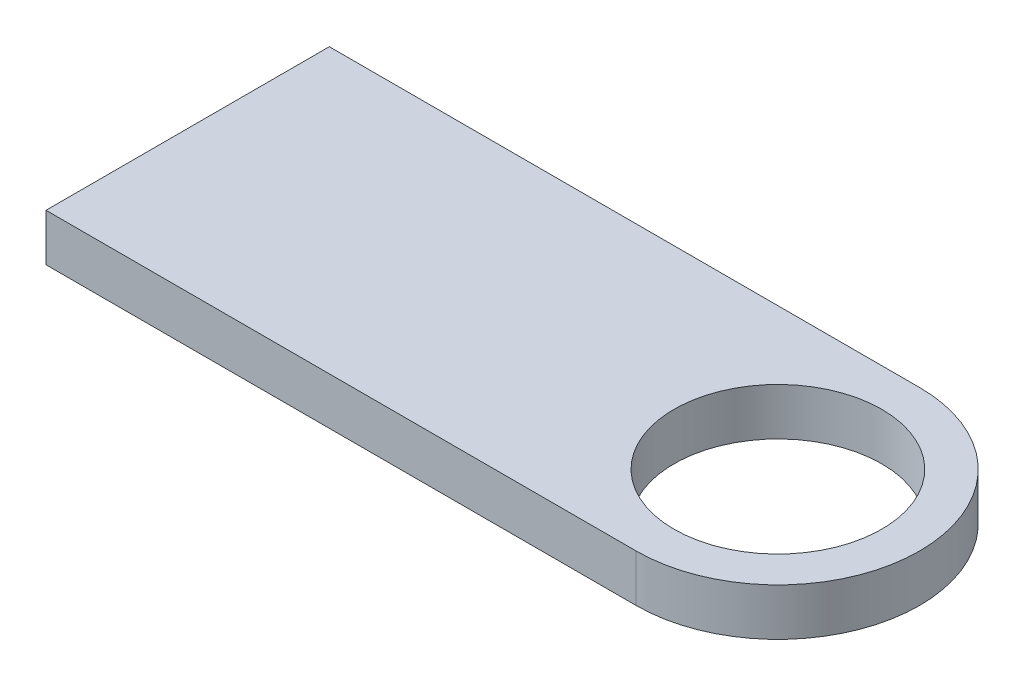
ISO-10303-21;
HEADER;
FILE_DESCRIPTION(('STEP AP214'),'2;1');
FILE_NAME('part.step','',(''),(''),'','','');
FILE_SCHEMA(('AUTOMOTIVE_DESIGN { 1 0 10303 214 1 1 1 1 }'));
ENDSEC;
DATA;
#1=APPLICATION_CONTEXT('core data for automotive mechanical design processes');
#2=APPLICATION_PROTOCOL_DEFINITION('international standard','automotive_design',2000,#1);
#3=PRODUCT_CONTEXT('',#1,'mechanical');
#4=PRODUCT('Part','Part','',(#3));
#5=PRODUCT_RELATED_PRODUCT_CATEGORY('part','',(#4));
#6=PRODUCT_DEFINITION_FORMATION('','',#4);
#7=PRODUCT_DEFINITION_CONTEXT('part definition',#1,'design');
#8=PRODUCT_DEFINITION('design','',#6,#7);
#9=PRODUCT_DEFINITION_SHAPE('','',#8);
#10=(LENGTH_UNIT() NAMED_UNIT(*) SI_UNIT(.MILLI.,.METRE.));
#11=(NAMED_UNIT(*) PLANE_ANGLE_UNIT() SI_UNIT($,.RADIAN.));
#12=(NAMED_UNIT(*) SI_UNIT($,.STERADIAN.) SOLID_ANGLE_UNIT());
#13=UNCERTAINTY_MEASURE_WITH_UNIT(LENGTH_MEASURE(1.E-05),#10,'distance_accuracy_value','');
#14=(GEOMETRIC_REPRESENTATION_CONTEXT(3) GLOBAL_UNCERTAINTY_ASSIGNED_CONTEXT((#13)) GLOBAL_UNIT_ASSIGNED_CONTEXT((#10,
#11,#12)) REPRESENTATION_CONTEXT('',''));
#15=CARTESIAN_POINT('',(0.,0.,0.));
#16=DIRECTION('',(0.,0.,1.));
#17=DIRECTION('',(1.,0.,0.));
#18=AXIS2_PLACEMENT_3D('',#15,#16,#17);
#19=CARTESIAN_POINT('',(125.,-5.,-60.));
#20=DIRECTION('',(0.,0.,-1.));
#21=DIRECTION('',(-1.,0.,0.));
#22=AXIS2_PLACEMENT_3D('',#19,#20,#21);
#23=PLANE('',#22);
#24=DIRECTION('',(-1.,0.,0.));
#25=VECTOR('',#24,1.);
#26=CARTESIAN_POINT('',(125.,5.,-60.));
#27=LINE('',#26,#25);
#28=CARTESIAN_POINT('',(125.,5.,-60.));
#29=VERTEX_POINT('',#28);
#30=CARTESIAN_POINT('',(0.,5.,-60.));
#31=VERTEX_POINT('',#30);
#32=EDGE_CURVE('E100',#29,#31,#27,.T.);
#33=ORIENTED_EDGE('',*,*,#32,.F.);
#34=DIRECTION('',(0.,1.,0.));
#35=VECTOR('',#34,1.);
#36=CARTESIAN_POINT('',(125.,-5.,-60.));
#37=LINE('',#36,#35);
#38=CARTESIAN_POINT('',(125.,-5.,-60.));
#39=VERTEX_POINT('',#38);
#40=EDGE_CURVE('E11',#39,#29,#37,.T.);
#41=ORIENTED_EDGE('',*,*,#40,.F.);
#42=DIRECTION('',(-1.,0.,0.));
#43=VECTOR('',#42,1.);
#44=CARTESIAN_POINT('',(125.,-5.,-60.));
#45=LINE('',#44,#43);
#46=CARTESIAN_POINT('',(0.,-5.,-60.));
#47=VERTEX_POINT('',#46);
#48=EDGE_CURVE('E93',#39,#47,#45,.T.);
#49=ORIENTED_EDGE('',*,*,#48,.T.);
#50=DIRECTION('',(0.,1.,0.));
#51=VECTOR('',#50,1.);
#52=CARTESIAN_POINT('',(0.,-5.,-60.));
#53=LINE('',#52,#51);
#54=EDGE_CURVE('E38',#47,#31,#53,.T.);
#55=ORIENTED_EDGE('',*,*,#54,.T.);
#56=EDGE_LOOP('',(#33,#41,#49,#55));
#57=FACE_BOUND('',#56,.T.);
#58=ADVANCED_FACE('F35',(#57),#23,.T.);
#59=CARTESIAN_POINT('',(125.,-5.,-30.));
#60=DIRECTION('',(0.,1.,0.));
#61=DIRECTION('',(0.,0.,1.));
#62=AXIS2_PLACEMENT_3D('',#59,#60,#61);
#63=CYLINDRICAL_SURFACE('',#62,30.);
#64=CARTESIAN_POINT('',(125.,5.,-30.));
#65=DIRECTION('',(0.,1.,0.));
#66=DIRECTION('',(0.,0.,1.));
#67=AXIS2_PLACEMENT_3D('',#64,#65,#66);
#68=CIRCLE('',#67,30.);
#69=CARTESIAN_POINT('',(125.,5.,0.));
#70=VERTEX_POINT('',#69);
#71=EDGE_CURVE('E95',#70,#29,#68,.T.);
#72=ORIENTED_EDGE('',*,*,#71,.F.);
#73=DIRECTION('',(0.,1.,0.));
#74=VECTOR('',#73,1.);
#75=CARTESIAN_POINT('',(125.,-5.,0.));
#76=LINE('',#75,#74);
#77=CARTESIAN_POINT('',(125.,-5.,0.));
#78=VERTEX_POINT('',#77);
#79=EDGE_CURVE('E44',#78,#70,#76,.T.);
#80=ORIENTED_EDGE('',*,*,#79,.F.);
#81=CARTESIAN_POINT('',(125.,-5.,-30.));
#82=DIRECTION('',(0.,1.,0.));
#83=DIRECTION('',(0.,0.,1.));
#84=AXIS2_PLACEMENT_3D('',#81,#82,#83);
#85=CIRCLE('',#84,30.);
#86=EDGE_CURVE('E90',#78,#39,#85,.T.);
#87=ORIENTED_EDGE('',*,*,#86,.T.);
#88=ORIENTED_EDGE('',*,*,#40,.T.);
#89=EDGE_LOOP('',(#72,#80,#87,#88));
#90=FACE_BOUND('',#89,.T.);
#91=ADVANCED_FACE('F111',(#90),#63,.T.);
#92=CARTESIAN_POINT('',(0.,-5.,0.));
#93=DIRECTION('',(0.,0.,1.));
#94=DIRECTION('',(1.,0.,0.));
#95=AXIS2_PLACEMENT_3D('',#92,#93,#94);
#96=PLANE('',#95);
#97=DIRECTION('',(1.,0.,0.));
#98=VECTOR('',#97,1.);
#99=CARTESIAN_POINT('',(0.,5.,0.));
#100=LINE('',#99,#98);
#101=CARTESIAN_POINT('',(0.,5.,0.));
#102=VERTEX_POINT('',#101);
#103=EDGE_CURVE('E85',#102,#70,#100,.T.);
#104=ORIENTED_EDGE('',*,*,#103,.F.);
#105=DIRECTION('',(0.,1.,0.));
#106=VECTOR('',#105,1.);
#107=CARTESIAN_POINT('',(0.,-5.,0.));
#108=LINE('',#107,#106);
#109=CARTESIAN_POINT('',(0.,-5.,0.));
#110=VERTEX_POINT('',#109);
#111=EDGE_CURVE('E80',#110,#102,#108,.T.);
#112=ORIENTED_EDGE('',*,*,#111,.F.);
#113=DIRECTION('',(1.,0.,0.));
#114=VECTOR('',#113,1.);
#115=CARTESIAN_POINT('',(0.,-5.,0.));
#116=LINE('',#115,#114);
#117=EDGE_CURVE('E83',#110,#78,#116,.T.);
#118=ORIENTED_EDGE('',*,*,#117,.T.);
#119=ORIENTED_EDGE('',*,*,#79,.T.);
#120=EDGE_LOOP('',(#104,#112,#118,#119));
#121=FACE_BOUND('',#120,.T.);
#122=ADVANCED_FACE('F82',(#121),#96,.T.);
#123=CARTESIAN_POINT('',(0.,-5.,-60.));
#124=DIRECTION('',(-1.,0.,0.));
#125=DIRECTION('',(0.,0.,1.));
#126=AXIS2_PLACEMENT_3D('',#123,#124,#125);
#127=PLANE('',#126);
#128=DIRECTION('',(0.,0.,1.));
#129=VECTOR('',#128,1.);
#130=CARTESIAN_POINT('',(0.,5.,-60.));
#131=LINE('',#130,#129);
#132=EDGE_CURVE('E103',#31,#102,#131,.T.);
#133=ORIENTED_EDGE('',*,*,#132,.F.);
#134=ORIENTED_EDGE('',*,*,#54,.F.);
#135=DIRECTION('',(0.,0.,1.));
#136=VECTOR('',#135,1.);
#137=CARTESIAN_POINT('',(0.,-5.,-60.));
#138=LINE('',#137,#136);
#139=EDGE_CURVE('E89',#47,#110,#138,.T.);
#140=ORIENTED_EDGE('',*,*,#139,.T.);
#141=ORIENTED_EDGE('',*,*,#111,.T.);
#142=EDGE_LOOP('',(#133,#134,#140,#141));
#143=FACE_BOUND('',#142,.T.);
#144=ADVANCED_FACE('F92',(#143),#127,.T.);
#145=CARTESIAN_POINT('',(125.,-5.,-30.));
#146=DIRECTION('',(0.,1.,0.));
#147=DIRECTION('',(0.,0.,1.));
#148=AXIS2_PLACEMENT_3D('',#145,#146,#147);
#149=PLANE('',#148);
#150=CARTESIAN_POINT('',(125.,-5.,-30.));
#151=DIRECTION('',(0.,1.,0.));
#152=DIRECTION('',(0.,0.,-1.));
#153=AXIS2_PLACEMENT_3D('',#150,#151,#152);
#154=CIRCLE('',#153,22.);
#155=CARTESIAN_POINT('',(125.,-5.,-52.));
#156=VERTEX_POINT('',#155);
#157=EDGE_CURVE('E104',#156,#156,#154,.T.);
#158=ORIENTED_EDGE('',*,*,#157,.T.);
#159=EDGE_LOOP('',(#158));
#160=FACE_BOUND('',#159,.T.);
#161=ORIENTED_EDGE('',*,*,#48,.F.);
#162=ORIENTED_EDGE('',*,*,#86,.F.);
#163=ORIENTED_EDGE('',*,*,#117,.F.);
#164=ORIENTED_EDGE('',*,*,#139,.F.);
#165=EDGE_LOOP('',(#161,#162,#163,#164));
#166=FACE_BOUND('',#165,.T.);
#167=ADVANCED_FACE('F88',(#160,#166),#149,.F.);
#168=CARTESIAN_POINT('',(125.,5.,-30.));
#169=DIRECTION('',(0.,1.,0.));
#170=DIRECTION('',(0.,0.,1.));
#171=AXIS2_PLACEMENT_3D('',#168,#169,#170);
#172=PLANE('',#171);
#173=CARTESIAN_POINT('',(125.,5.,-30.));
#174=DIRECTION('',(0.,1.,0.));
#175=DIRECTION('',(0.,0.,-1.));
#176=AXIS2_PLACEMENT_3D('',#173,#174,#175);
#177=CIRCLE('',#176,22.);
#178=CARTESIAN_POINT('',(125.,5.,-52.));
#179=VERTEX_POINT('',#178);
#180=EDGE_CURVE('E141',#179,#179,#177,.T.);
#181=ORIENTED_EDGE('',*,*,#180,.F.);
#182=EDGE_LOOP('',(#181));
#183=FACE_BOUND('',#182,.T.);
#184=ORIENTED_EDGE('',*,*,#32,.T.);
#185=ORIENTED_EDGE('',*,*,#132,.T.);
#186=ORIENTED_EDGE('',*,*,#103,.T.);
#187=ORIENTED_EDGE('',*,*,#71,.T.);
#188=EDGE_LOOP('',(#184,#185,#186,#187));
#189=FACE_BOUND('',#188,.T.);
#190=ADVANCED_FACE('F110',(#183,#189),#172,.T.);
#191=CARTESIAN_POINT('',(125.,-5.,-30.));
#192=DIRECTION('',(0.,1.,0.));
#193=DIRECTION('',(0.,0.,1.));
#194=AXIS2_PLACEMENT_3D('',#191,#192,#193);
#195=CYLINDRICAL_SURFACE('',#194,22.);
#196=ORIENTED_EDGE('',*,*,#157,.F.);
#197=EDGE_LOOP('',(#196));
#198=FACE_BOUND('',#197,.T.);
#199=ORIENTED_EDGE('',*,*,#180,.T.);
#200=EDGE_LOOP('',(#199));
#201=FACE_BOUND('',#200,.T.);
#202=ADVANCED_FACE('F129',(#198,#201),#195,.F.);
#203=CLOSED_SHELL('',(#58,#91,#122,#144,#167,#190,#202));
#204=MANIFOLD_SOLID_BREP('B2',#203);
#205=ADVANCED_BREP_SHAPE_REPRESENTATION('',(#18,#204),#14);
#206=SHAPE_DEFINITION_REPRESENTATION(#9,#205);
ENDSEC;
END-ISO-10303-21;
